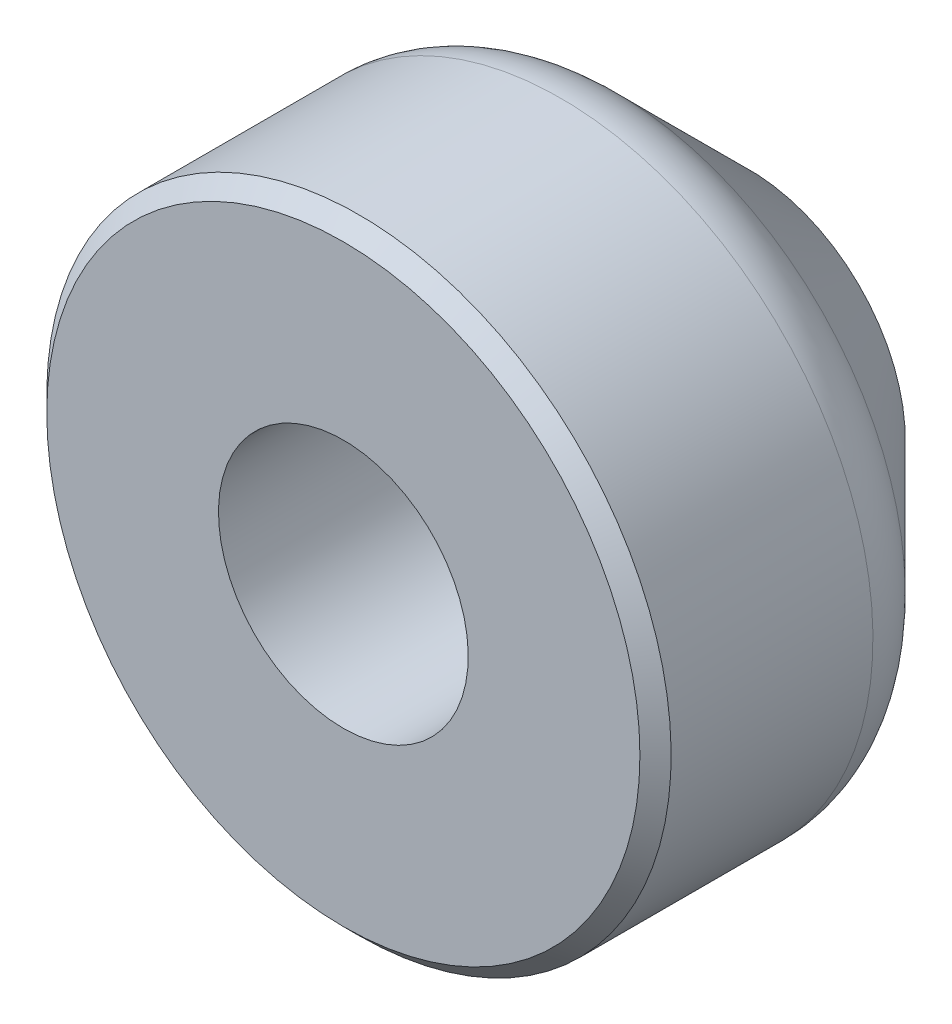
ISO-10303-21;
HEADER;
FILE_DESCRIPTION(('STEP AP214'),'2;1');
FILE_NAME('part.step','',(''),(''),'','','');
FILE_SCHEMA(('AUTOMOTIVE_DESIGN { 1 0 10303 214 1 1 1 1 }'));
ENDSEC;
DATA;
#1=APPLICATION_CONTEXT('core data for automotive mechanical design processes');
#2=APPLICATION_PROTOCOL_DEFINITION('international standard','automotive_design',2000,#1);
#3=PRODUCT_CONTEXT('',#1,'mechanical');
#4=PRODUCT('Part','Part','',(#3));
#5=PRODUCT_RELATED_PRODUCT_CATEGORY('part','',(#4));
#6=PRODUCT_DEFINITION_FORMATION('','',#4);
#7=PRODUCT_DEFINITION_CONTEXT('part definition',#1,'design');
#8=PRODUCT_DEFINITION('design','',#6,#7);
#9=PRODUCT_DEFINITION_SHAPE('','',#8);
#10=(LENGTH_UNIT() NAMED_UNIT(*) SI_UNIT(.MILLI.,.METRE.));
#11=(NAMED_UNIT(*) PLANE_ANGLE_UNIT() SI_UNIT($,.RADIAN.));
#12=(NAMED_UNIT(*) SI_UNIT($,.STERADIAN.) SOLID_ANGLE_UNIT());
#13=UNCERTAINTY_MEASURE_WITH_UNIT(LENGTH_MEASURE(1.E-05),#10,'distance_accuracy_value','');
#14=(GEOMETRIC_REPRESENTATION_CONTEXT(3) GLOBAL_UNCERTAINTY_ASSIGNED_CONTEXT((#13)) GLOBAL_UNIT_ASSIGNED_CONTEXT((#10,
#11,#12)) REPRESENTATION_CONTEXT('',''));
#15=CARTESIAN_POINT('',(0.,0.,0.));
#16=DIRECTION('',(0.,0.,1.));
#17=DIRECTION('',(1.,0.,0.));
#18=AXIS2_PLACEMENT_3D('',#15,#16,#17);
#19=CARTESIAN_POINT('',(0.,-8.,26.));
#20=DIRECTION('',(0.,0.,1.));
#21=DIRECTION('',(0.,-1.,0.));
#22=AXIS2_PLACEMENT_3D('',#19,#20,#21);
#23=PLANE('',#22);
#24=CARTESIAN_POINT('',(0.,0.,26.));
#25=DIRECTION('',(0.,0.,1.));
#26=DIRECTION('',(0.,-1.,0.));
#27=AXIS2_PLACEMENT_3D('',#24,#25,#26);
#28=CIRCLE('',#27,19.);
#29=CARTESIAN_POINT('',(0.,-19.,26.));
#30=VERTEX_POINT('',#29);
#31=EDGE_CURVE('E8',#30,#30,#28,.T.);
#32=ORIENTED_EDGE('',*,*,#31,.T.);
#33=EDGE_LOOP('',(#32));
#34=FACE_BOUND('',#33,.T.);
#35=CARTESIAN_POINT('',(0.,0.,26.));
#36=DIRECTION('',(0.,0.,1.));
#37=DIRECTION('',(0.,-1.,0.));
#38=AXIS2_PLACEMENT_3D('',#35,#36,#37);
#39=CIRCLE('',#38,8.);
#40=CARTESIAN_POINT('',(0.,-8.,26.));
#41=VERTEX_POINT('',#40);
#42=EDGE_CURVE('E37',#41,#41,#39,.T.);
#43=ORIENTED_EDGE('',*,*,#42,.F.);
#44=EDGE_LOOP('',(#43));
#45=FACE_BOUND('',#44,.T.);
#46=ADVANCED_FACE('F12',(#34,#45),#23,.T.);
#47=CARTESIAN_POINT('',(0.,0.,26.));
#48=DIRECTION('',(0.,0.,-1.));
#49=DIRECTION('',(0.,1.,0.));
#50=AXIS2_PLACEMENT_3D('',#47,#48,#49);
#51=CONICAL_SURFACE('',#50,19.,0.78539816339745);
#52=CARTESIAN_POINT('',(0.,0.,25.));
#53=DIRECTION('',(0.,0.,1.));
#54=DIRECTION('',(0.,-1.,0.));
#55=AXIS2_PLACEMENT_3D('',#52,#53,#54);
#56=CIRCLE('',#55,20.);
#57=CARTESIAN_POINT('',(0.,-20.,25.));
#58=VERTEX_POINT('',#57);
#59=EDGE_CURVE('E18',#58,#58,#56,.T.);
#60=ORIENTED_EDGE('',*,*,#59,.T.);
#61=EDGE_LOOP('',(#60));
#62=FACE_BOUND('',#61,.T.);
#63=ORIENTED_EDGE('',*,*,#31,.F.);
#64=EDGE_LOOP('',(#63));
#65=FACE_BOUND('',#64,.T.);
#66=ADVANCED_FACE('F44',(#62,#65),#51,.T.);
#67=CARTESIAN_POINT('',(0.,0.,35.92654879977));
#68=DIRECTION('',(0.,0.,1.));
#69=DIRECTION('',(0.,-1.,0.));
#70=AXIS2_PLACEMENT_3D('',#67,#68,#69);
#71=CYLINDRICAL_SURFACE('',#70,20.);
#72=CARTESIAN_POINT('',(0.,0.,12.0710678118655));
#73=DIRECTION('',(0.,0.,1.));
#74=DIRECTION('',(0.,-1.,0.));
#75=AXIS2_PLACEMENT_3D('',#72,#73,#74);
#76=CIRCLE('',#75,20.);
#77=CARTESIAN_POINT('',(0.,-20.,12.0710678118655));
#78=VERTEX_POINT('',#77);
#79=EDGE_CURVE('E22',#78,#78,#76,.T.);
#80=ORIENTED_EDGE('',*,*,#79,.T.);
#81=EDGE_LOOP('',(#80));
#82=FACE_BOUND('',#81,.T.);
#83=ORIENTED_EDGE('',*,*,#59,.F.);
#84=EDGE_LOOP('',(#83));
#85=FACE_BOUND('',#84,.T.);
#86=ADVANCED_FACE('F50',(#82,#85),#71,.T.);
#87=CARTESIAN_POINT('',(0.,0.,12.0710678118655));
#88=DIRECTION('',(0.,0.,1.));
#89=DIRECTION('',(0.,-1.,0.));
#90=AXIS2_PLACEMENT_3D('',#87,#88,#89);
#91=TOROIDAL_SURFACE('',#90,15.,5.);
#92=CARTESIAN_POINT('',(0.,0.,8.53553390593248));
#93=DIRECTION('',(0.,0.,1.));
#94=DIRECTION('',(0.,-1.,0.));
#95=AXIS2_PLACEMENT_3D('',#92,#93,#94);
#96=CIRCLE('',#95,18.5355339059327);
#97=CARTESIAN_POINT('',(0.,-18.5355339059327,8.53553390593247));
#98=VERTEX_POINT('',#97);
#99=EDGE_CURVE('E26',#98,#98,#96,.T.);
#100=ORIENTED_EDGE('',*,*,#99,.T.);
#101=EDGE_LOOP('',(#100));
#102=FACE_BOUND('',#101,.T.);
#103=ORIENTED_EDGE('',*,*,#79,.F.);
#104=EDGE_LOOP('',(#103));
#105=FACE_BOUND('',#104,.T.);
#106=ADVANCED_FACE('F55',(#102,#105),#91,.T.);
#107=CARTESIAN_POINT('',(0.,0.,8.53553390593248));
#108=DIRECTION('',(0.,0.,1.));
#109=DIRECTION('',(0.,-1.,0.));
#110=AXIS2_PLACEMENT_3D('',#107,#108,#109);
#111=CONICAL_SURFACE('',#110,18.5355339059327,0.785398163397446);
#112=CARTESIAN_POINT('',(0.,0.,0.));
#113=DIRECTION('',(0.,0.,1.));
#114=DIRECTION('',(0.,-1.,0.));
#115=AXIS2_PLACEMENT_3D('',#112,#113,#114);
#116=CIRCLE('',#115,10.);
#117=CARTESIAN_POINT('',(0.,-10.,0.));
#118=VERTEX_POINT('',#117);
#119=EDGE_CURVE('E31',#118,#118,#116,.T.);
#120=ORIENTED_EDGE('',*,*,#119,.T.);
#121=EDGE_LOOP('',(#120));
#122=FACE_BOUND('',#121,.T.);
#123=ORIENTED_EDGE('',*,*,#99,.F.);
#124=EDGE_LOOP('',(#123));
#125=FACE_BOUND('',#124,.T.);
#126=ADVANCED_FACE('F62',(#122,#125),#111,.T.);
#127=CARTESIAN_POINT('',(0.,-10.,0.));
#128=DIRECTION('',(0.,0.,-1.));
#129=DIRECTION('',(0.,1.,0.));
#130=AXIS2_PLACEMENT_3D('',#127,#128,#129);
#131=PLANE('',#130);
#132=CARTESIAN_POINT('',(0.,0.,0.));
#133=DIRECTION('',(0.,0.,1.));
#134=DIRECTION('',(0.,-1.,0.));
#135=AXIS2_PLACEMENT_3D('',#132,#133,#134);
#136=CIRCLE('',#135,8.);
#137=CARTESIAN_POINT('',(0.,-8.,0.));
#138=VERTEX_POINT('',#137);
#139=EDGE_CURVE('E34',#138,#138,#136,.T.);
#140=ORIENTED_EDGE('',*,*,#139,.T.);
#141=EDGE_LOOP('',(#140));
#142=FACE_BOUND('',#141,.T.);
#143=ORIENTED_EDGE('',*,*,#119,.F.);
#144=EDGE_LOOP('',(#143));
#145=FACE_BOUND('',#144,.T.);
#146=ADVANCED_FACE('F66',(#142,#145),#131,.T.);
#147=CARTESIAN_POINT('',(0.,0.,35.92654879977));
#148=DIRECTION('',(0.,0.,1.));
#149=DIRECTION('',(0.,-1.,0.));
#150=AXIS2_PLACEMENT_3D('',#147,#148,#149);
#151=CYLINDRICAL_SURFACE('',#150,8.);
#152=ORIENTED_EDGE('',*,*,#139,.F.);
#153=EDGE_LOOP('',(#152));
#154=FACE_BOUND('',#153,.T.);
#155=ORIENTED_EDGE('',*,*,#42,.T.);
#156=EDGE_LOOP('',(#155));
#157=FACE_BOUND('',#156,.T.);
#158=ADVANCED_FACE('F41',(#154,#157),#151,.F.);
#159=CLOSED_SHELL('',(#46,#66,#86,#106,#126,#146,#158));
#160=MANIFOLD_SOLID_BREP('B1',#159);
#161=ADVANCED_BREP_SHAPE_REPRESENTATION('',(#18,#160),#14);
#162=SHAPE_DEFINITION_REPRESENTATION(#9,#161);
ENDSEC;
END-ISO-10303-21;
